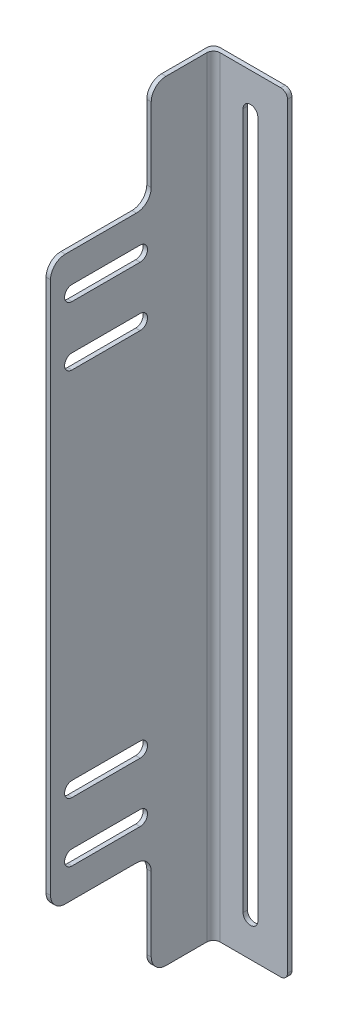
ISO-10303-21;
HEADER;
FILE_DESCRIPTION(('STEP AP214'),'2;1');
FILE_NAME('part.step','',(''),(''),'','','');
FILE_SCHEMA(('AUTOMOTIVE_DESIGN { 1 0 10303 214 1 1 1 1 }'));
ENDSEC;
DATA;
#1=APPLICATION_CONTEXT('core data for automotive mechanical design processes');
#2=APPLICATION_PROTOCOL_DEFINITION('international standard','automotive_design',2000,#1);
#3=PRODUCT_CONTEXT('',#1,'mechanical');
#4=PRODUCT('Part','Part','',(#3));
#5=PRODUCT_RELATED_PRODUCT_CATEGORY('part','',(#4));
#6=PRODUCT_DEFINITION_FORMATION('','',#4);
#7=PRODUCT_DEFINITION_CONTEXT('part definition',#1,'design');
#8=PRODUCT_DEFINITION('design','',#6,#7);
#9=PRODUCT_DEFINITION_SHAPE('','',#8);
#10=(LENGTH_UNIT() NAMED_UNIT(*) SI_UNIT(.MILLI.,.METRE.));
#11=(NAMED_UNIT(*) PLANE_ANGLE_UNIT() SI_UNIT($,.RADIAN.));
#12=(NAMED_UNIT(*) SI_UNIT($,.STERADIAN.) SOLID_ANGLE_UNIT());
#13=UNCERTAINTY_MEASURE_WITH_UNIT(LENGTH_MEASURE(1.E-05),#10,'distance_accuracy_value','');
#14=(GEOMETRIC_REPRESENTATION_CONTEXT(3) GLOBAL_UNCERTAINTY_ASSIGNED_CONTEXT((#13)) GLOBAL_UNIT_ASSIGNED_CONTEXT((#10,
#11,#12)) REPRESENTATION_CONTEXT('',''));
#15=CARTESIAN_POINT('',(0.,0.,0.));
#16=DIRECTION('',(0.,0.,1.));
#17=DIRECTION('',(1.,0.,0.));
#18=AXIS2_PLACEMENT_3D('',#15,#16,#17);
#19=CARTESIAN_POINT('',(25.,-25.,3.));
#20=DIRECTION('',(0.,0.,1.));
#21=DIRECTION('',(1.,0.,0.));
#22=AXIS2_PLACEMENT_3D('',#19,#20,#21);
#23=PLANE('',#22);
#24=DIRECTION('',(0.,1.,0.));
#25=VECTOR('',#24,1.);
#26=CARTESIAN_POINT('',(25.,495.,3.));
#27=LINE('',#26,#25);
#28=CARTESIAN_POINT('',(25.,-20.5,3.));
#29=VERTEX_POINT('',#28);
#30=CARTESIAN_POINT('',(25.,490.5,3.));
#31=VERTEX_POINT('',#30);
#32=EDGE_CURVE('E441',#29,#31,#27,.T.);
#33=ORIENTED_EDGE('',*,*,#32,.T.);
#34=CARTESIAN_POINT('',(20.5,490.5,3.));
#35=DIRECTION('',(0.,0.,1.));
#36=DIRECTION('',(1.,0.,0.));
#37=AXIS2_PLACEMENT_3D('',#34,#35,#36);
#38=CIRCLE('',#37,4.5);
#39=CARTESIAN_POINT('',(20.5,495.,3.));
#40=VERTEX_POINT('',#39);
#41=EDGE_CURVE('E668',#31,#40,#38,.T.);
#42=ORIENTED_EDGE('',*,*,#41,.T.);
#43=DIRECTION('',(-1.,0.,0.));
#44=VECTOR('',#43,1.);
#45=CARTESIAN_POINT('',(-25.,495.,3.));
#46=LINE('',#45,#44);
#47=CARTESIAN_POINT('',(-20.5,495.,3.));
#48=VERTEX_POINT('',#47);
#49=EDGE_CURVE('E434',#40,#48,#46,.T.);
#50=ORIENTED_EDGE('',*,*,#49,.T.);
#51=DIRECTION('',(0.,-1.,0.));
#52=VECTOR('',#51,1.);
#53=CARTESIAN_POINT('',(-20.5,-25.,3.));
#54=LINE('',#53,#52);
#55=CARTESIAN_POINT('',(-20.5,-25.,3.));
#56=VERTEX_POINT('',#55);
#57=EDGE_CURVE('E672',#48,#56,#54,.T.);
#58=ORIENTED_EDGE('',*,*,#57,.T.);
#59=DIRECTION('',(1.,0.,0.));
#60=VECTOR('',#59,1.);
#61=CARTESIAN_POINT('',(-25.,-25.,3.));
#62=LINE('',#61,#60);
#63=CARTESIAN_POINT('',(20.5,-25.,3.));
#64=VERTEX_POINT('',#63);
#65=EDGE_CURVE('E431',#56,#64,#62,.T.);
#66=ORIENTED_EDGE('',*,*,#65,.T.);
#67=CARTESIAN_POINT('',(20.5,-20.5,3.));
#68=DIRECTION('',(0.,0.,1.));
#69=DIRECTION('',(1.,0.,0.));
#70=AXIS2_PLACEMENT_3D('',#67,#68,#69);
#71=CIRCLE('',#70,4.5);
#72=EDGE_CURVE('E670',#64,#29,#71,.T.);
#73=ORIENTED_EDGE('',*,*,#72,.T.);
#74=EDGE_LOOP('',(#33,#42,#50,#58,#66,#73));
#75=FACE_BOUND('',#74,.T.);
#76=DIRECTION('',(0.,1.,0.));
#77=VECTOR('',#76,1.);
#78=CARTESIAN_POINT('',(5.,0.,3.));
#79=LINE('',#78,#77);
#80=CARTESIAN_POINT('',(5.,0.,3.));
#81=VERTEX_POINT('',#80);
#82=CARTESIAN_POINT('',(5.,470.,3.));
#83=VERTEX_POINT('',#82);
#84=EDGE_CURVE('E479',#81,#83,#79,.T.);
#85=ORIENTED_EDGE('',*,*,#84,.F.);
#86=CARTESIAN_POINT('',(0.,0.,3.));
#87=DIRECTION('',(0.,0.,1.));
#88=DIRECTION('',(1.,0.,0.));
#89=AXIS2_PLACEMENT_3D('',#86,#87,#88);
#90=CIRCLE('',#89,5.);
#91=CARTESIAN_POINT('',(-5.,0.,3.));
#92=VERTEX_POINT('',#91);
#93=EDGE_CURVE('E464',#92,#81,#90,.T.);
#94=ORIENTED_EDGE('',*,*,#93,.F.);
#95=DIRECTION('',(0.,-1.,0.));
#96=VECTOR('',#95,1.);
#97=CARTESIAN_POINT('',(-5.,0.,3.));
#98=LINE('',#97,#96);
#99=CARTESIAN_POINT('',(-5.,470.,3.));
#100=VERTEX_POINT('',#99);
#101=EDGE_CURVE('E460',#100,#92,#98,.T.);
#102=ORIENTED_EDGE('',*,*,#101,.F.);
#103=CARTESIAN_POINT('',(0.,470.,3.));
#104=DIRECTION('',(0.,0.,1.));
#105=DIRECTION('',(1.,0.,0.));
#106=AXIS2_PLACEMENT_3D('',#103,#104,#105);
#107=CIRCLE('',#106,5.);
#108=EDGE_CURVE('E476',#83,#100,#107,.T.);
#109=ORIENTED_EDGE('',*,*,#108,.F.);
#110=EDGE_LOOP('',(#85,#94,#102,#109));
#111=FACE_BOUND('',#110,.T.);
#112=ADVANCED_FACE('F34',(#75,#111),#23,.T.);
#113=CARTESIAN_POINT('',(25.,-25.,0.));
#114=DIRECTION('',(0.,0.,1.));
#115=DIRECTION('',(1.,0.,0.));
#116=AXIS2_PLACEMENT_3D('',#113,#114,#115);
#117=PLANE('',#116);
#118=DIRECTION('',(-1.,0.,0.));
#119=VECTOR('',#118,1.);
#120=CARTESIAN_POINT('',(-25.,495.,0.));
#121=LINE('',#120,#119);
#122=CARTESIAN_POINT('',(20.5,495.,0.));
#123=VERTEX_POINT('',#122);
#124=CARTESIAN_POINT('',(-23.5,495.,0.));
#125=VERTEX_POINT('',#124);
#126=EDGE_CURVE('E442',#123,#125,#121,.T.);
#127=ORIENTED_EDGE('',*,*,#126,.F.);
#128=CARTESIAN_POINT('',(20.5,490.5,0.));
#129=DIRECTION('',(0.,0.,1.));
#130=DIRECTION('',(1.,0.,0.));
#131=AXIS2_PLACEMENT_3D('',#128,#129,#130);
#132=CIRCLE('',#131,4.5);
#133=CARTESIAN_POINT('',(25.,490.5,0.));
#134=VERTEX_POINT('',#133);
#135=EDGE_CURVE('E680',#123,#134,#132,.F.);
#136=ORIENTED_EDGE('',*,*,#135,.T.);
#137=DIRECTION('',(0.,1.,0.));
#138=VECTOR('',#137,1.);
#139=CARTESIAN_POINT('',(25.,495.,0.));
#140=LINE('',#139,#138);
#141=CARTESIAN_POINT('',(25.,-20.5,0.));
#142=VERTEX_POINT('',#141);
#143=EDGE_CURVE('E445',#142,#134,#140,.T.);
#144=ORIENTED_EDGE('',*,*,#143,.F.);
#145=CARTESIAN_POINT('',(20.5,-20.5,0.));
#146=DIRECTION('',(0.,0.,1.));
#147=DIRECTION('',(1.,0.,0.));
#148=AXIS2_PLACEMENT_3D('',#145,#146,#147);
#149=CIRCLE('',#148,4.5);
#150=CARTESIAN_POINT('',(20.5,-25.,0.));
#151=VERTEX_POINT('',#150);
#152=EDGE_CURVE('E682',#142,#151,#149,.F.);
#153=ORIENTED_EDGE('',*,*,#152,.T.);
#154=DIRECTION('',(1.,0.,0.));
#155=VECTOR('',#154,1.);
#156=CARTESIAN_POINT('',(-25.,-25.,0.));
#157=LINE('',#156,#155);
#158=CARTESIAN_POINT('',(-23.5,-25.,0.));
#159=VERTEX_POINT('',#158);
#160=EDGE_CURVE('E438',#159,#151,#157,.T.);
#161=ORIENTED_EDGE('',*,*,#160,.F.);
#162=DIRECTION('',(0.,-1.,0.));
#163=VECTOR('',#162,1.);
#164=CARTESIAN_POINT('',(-23.5,495.,0.));
#165=LINE('',#164,#163);
#166=EDGE_CURVE('E684',#159,#125,#165,.F.);
#167=ORIENTED_EDGE('',*,*,#166,.T.);
#168=EDGE_LOOP('',(#127,#136,#144,#153,#161,#167));
#169=FACE_BOUND('',#168,.T.);
#170=CARTESIAN_POINT('',(0.,0.,0.));
#171=DIRECTION('',(0.,0.,1.));
#172=DIRECTION('',(1.,0.,0.));
#173=AXIS2_PLACEMENT_3D('',#170,#171,#172);
#174=CIRCLE('',#173,5.);
#175=CARTESIAN_POINT('',(-5.,0.,0.));
#176=VERTEX_POINT('',#175);
#177=CARTESIAN_POINT('',(5.,0.,0.));
#178=VERTEX_POINT('',#177);
#179=EDGE_CURVE('E471',#176,#178,#174,.T.);
#180=ORIENTED_EDGE('',*,*,#179,.T.);
#181=DIRECTION('',(0.,1.,0.));
#182=VECTOR('',#181,1.);
#183=CARTESIAN_POINT('',(5.,0.,0.));
#184=LINE('',#183,#182);
#185=CARTESIAN_POINT('',(5.,470.,0.));
#186=VERTEX_POINT('',#185);
#187=EDGE_CURVE('E468',#178,#186,#184,.T.);
#188=ORIENTED_EDGE('',*,*,#187,.T.);
#189=CARTESIAN_POINT('',(0.,470.,0.));
#190=DIRECTION('',(0.,0.,1.));
#191=DIRECTION('',(1.,0.,0.));
#192=AXIS2_PLACEMENT_3D('',#189,#190,#191);
#193=CIRCLE('',#192,5.);
#194=CARTESIAN_POINT('',(-5.,470.,0.));
#195=VERTEX_POINT('',#194);
#196=EDGE_CURVE('E465',#186,#195,#193,.T.);
#197=ORIENTED_EDGE('',*,*,#196,.T.);
#198=DIRECTION('',(0.,-1.,0.));
#199=VECTOR('',#198,1.);
#200=CARTESIAN_POINT('',(-5.,0.,0.));
#201=LINE('',#200,#199);
#202=EDGE_CURVE('E461',#195,#176,#201,.T.);
#203=ORIENTED_EDGE('',*,*,#202,.T.);
#204=EDGE_LOOP('',(#180,#188,#197,#203));
#205=FACE_BOUND('',#204,.T.);
#206=ADVANCED_FACE('F539',(#169,#205),#117,.F.);
#207=CARTESIAN_POINT('',(25.,495.,3.));
#208=DIRECTION('',(-1.,0.,0.));
#209=DIRECTION('',(0.,0.,1.));
#210=AXIS2_PLACEMENT_3D('',#207,#208,#209);
#211=PLANE('',#210);
#212=ORIENTED_EDGE('',*,*,#143,.T.);
#213=DIRECTION('',(0.,0.,-1.));
#214=VECTOR('',#213,1.);
#215=CARTESIAN_POINT('',(25.,490.5,3.));
#216=LINE('',#215,#214);
#217=EDGE_CURVE('E675',#134,#31,#216,.F.);
#218=ORIENTED_EDGE('',*,*,#217,.T.);
#219=ORIENTED_EDGE('',*,*,#32,.F.);
#220=DIRECTION('',(0.,0.,-1.));
#221=VECTOR('',#220,1.);
#222=CARTESIAN_POINT('',(25.,-20.5,3.));
#223=LINE('',#222,#221);
#224=EDGE_CURVE('E677',#29,#142,#223,.T.);
#225=ORIENTED_EDGE('',*,*,#224,.T.);
#226=EDGE_LOOP('',(#212,#218,#219,#225));
#227=FACE_BOUND('',#226,.T.);
#228=ADVANCED_FACE('F545',(#227),#211,.F.);
#229=CARTESIAN_POINT('',(-25.,495.,3.));
#230=DIRECTION('',(0.,-1.,0.));
#231=DIRECTION('',(0.,0.,-1.));
#232=AXIS2_PLACEMENT_3D('',#229,#230,#231);
#233=PLANE('',#232);
#234=DIRECTION('',(0.,0.,1.));
#235=VECTOR('',#234,1.);
#236=CARTESIAN_POINT('',(-28.,495.,56.4999999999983));
#237=LINE('',#236,#235);
#238=CARTESIAN_POINT('',(-28.,495.,4.5));
#239=VERTEX_POINT('',#238);
#240=CARTESIAN_POINT('',(-28.,495.,35.));
#241=VERTEX_POINT('',#240);
#242=EDGE_CURVE('E359',#239,#241,#237,.T.);
#243=ORIENTED_EDGE('',*,*,#242,.T.);
#244=DIRECTION('',(-1.,0.,0.));
#245=VECTOR('',#244,1.);
#246=CARTESIAN_POINT('',(-25.,495.,35.));
#247=LINE('',#246,#245);
#248=CARTESIAN_POINT('',(-25.,495.,35.));
#249=VERTEX_POINT('',#248);
#250=EDGE_CURVE('E624',#241,#249,#247,.F.);
#251=ORIENTED_EDGE('',*,*,#250,.T.);
#252=DIRECTION('',(0.,0.,1.));
#253=VECTOR('',#252,1.);
#254=CARTESIAN_POINT('',(-25.,495.,56.4999999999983));
#255=LINE('',#254,#253);
#256=CARTESIAN_POINT('',(-25.,495.,7.5));
#257=VERTEX_POINT('',#256);
#258=EDGE_CURVE('E415',#257,#249,#255,.T.);
#259=ORIENTED_EDGE('',*,*,#258,.F.);
#260=CARTESIAN_POINT('',(-20.5,495.,7.5));
#261=DIRECTION('',(0.,-1.,0.));
#262=DIRECTION('',(0.,0.,-1.));
#263=AXIS2_PLACEMENT_3D('',#260,#261,#262);
#264=CIRCLE('',#263,4.5);
#265=EDGE_CURVE('E664',#257,#48,#264,.T.);
#266=ORIENTED_EDGE('',*,*,#265,.T.);
#267=ORIENTED_EDGE('',*,*,#49,.F.);
#268=DIRECTION('',(0.,0.,-1.));
#269=VECTOR('',#268,1.);
#270=CARTESIAN_POINT('',(20.5,495.,3.));
#271=LINE('',#270,#269);
#272=EDGE_CURVE('E686',#40,#123,#271,.T.);
#273=ORIENTED_EDGE('',*,*,#272,.T.);
#274=ORIENTED_EDGE('',*,*,#126,.T.);
#275=CARTESIAN_POINT('',(-23.5,495.,4.5));
#276=DIRECTION('',(0.,-1.,0.));
#277=DIRECTION('',(0.,0.,-1.));
#278=AXIS2_PLACEMENT_3D('',#275,#276,#277);
#279=CIRCLE('',#278,4.5);
#280=EDGE_CURVE('E689',#125,#239,#279,.F.);
#281=ORIENTED_EDGE('',*,*,#280,.T.);
#282=EDGE_LOOP('',(#243,#251,#259,#266,#267,#273,#274,#281));
#283=FACE_BOUND('',#282,.T.);
#284=ADVANCED_FACE('F556',(#283),#233,.F.);
#285=CARTESIAN_POINT('',(-25.,-25.,3.));
#286=DIRECTION('',(0.,1.,0.));
#287=DIRECTION('',(0.,0.,1.));
#288=AXIS2_PLACEMENT_3D('',#285,#286,#287);
#289=PLANE('',#288);
#290=DIRECTION('',(0.,0.,1.));
#291=VECTOR('',#290,1.);
#292=CARTESIAN_POINT('',(-25.,-25.,56.5));
#293=LINE('',#292,#291);
#294=CARTESIAN_POINT('',(-25.,-25.,7.5));
#295=VERTEX_POINT('',#294);
#296=CARTESIAN_POINT('',(-25.,-25.,35.));
#297=VERTEX_POINT('',#296);
#298=EDGE_CURVE('E314',#295,#297,#293,.T.);
#299=ORIENTED_EDGE('',*,*,#298,.T.);
#300=DIRECTION('',(-1.,0.,0.));
#301=VECTOR('',#300,1.);
#302=CARTESIAN_POINT('',(-25.,-25.,35.));
#303=LINE('',#302,#301);
#304=CARTESIAN_POINT('',(-28.,-25.,35.));
#305=VERTEX_POINT('',#304);
#306=EDGE_CURVE('E661',#297,#305,#303,.T.);
#307=ORIENTED_EDGE('',*,*,#306,.T.);
#308=DIRECTION('',(0.,0.,1.));
#309=VECTOR('',#308,1.);
#310=CARTESIAN_POINT('',(-28.,-25.,56.5));
#311=LINE('',#310,#309);
#312=CARTESIAN_POINT('',(-28.,-25.,4.5));
#313=VERTEX_POINT('',#312);
#314=EDGE_CURVE('E362',#313,#305,#311,.T.);
#315=ORIENTED_EDGE('',*,*,#314,.F.);
#316=CARTESIAN_POINT('',(-23.5,-25.,4.5));
#317=DIRECTION('',(0.,1.,0.));
#318=DIRECTION('',(0.,0.,1.));
#319=AXIS2_PLACEMENT_3D('',#316,#317,#318);
#320=CIRCLE('',#319,4.5);
#321=EDGE_CURVE('E430',#313,#159,#320,.F.);
#322=ORIENTED_EDGE('',*,*,#321,.T.);
#323=ORIENTED_EDGE('',*,*,#160,.T.);
#324=DIRECTION('',(0.,0.,-1.));
#325=VECTOR('',#324,1.);
#326=CARTESIAN_POINT('',(20.5,-25.,3.));
#327=LINE('',#326,#325);
#328=EDGE_CURVE('E695',#151,#64,#327,.F.);
#329=ORIENTED_EDGE('',*,*,#328,.T.);
#330=ORIENTED_EDGE('',*,*,#65,.F.);
#331=CARTESIAN_POINT('',(-20.5,-25.,7.5));
#332=DIRECTION('',(0.,1.,0.));
#333=DIRECTION('',(0.,0.,1.));
#334=AXIS2_PLACEMENT_3D('',#331,#332,#333);
#335=CIRCLE('',#334,4.5);
#336=EDGE_CURVE('E666',#56,#295,#335,.T.);
#337=ORIENTED_EDGE('',*,*,#336,.T.);
#338=EDGE_LOOP('',(#299,#307,#315,#322,#323,#329,#330,#337));
#339=FACE_BOUND('',#338,.T.);
#340=ADVANCED_FACE('F553',(#339),#289,.F.);
#341=CARTESIAN_POINT('',(0.,0.,3.));
#342=DIRECTION('',(0.,0.,-1.));
#343=DIRECTION('',(-1.,0.,0.));
#344=AXIS2_PLACEMENT_3D('',#341,#342,#343);
#345=CYLINDRICAL_SURFACE('',#344,5.);
#346=ORIENTED_EDGE('',*,*,#179,.F.);
#347=DIRECTION('',(0.,0.,-1.));
#348=VECTOR('',#347,1.);
#349=CARTESIAN_POINT('',(-5.,0.,3.));
#350=LINE('',#349,#348);
#351=EDGE_CURVE('E457',#92,#176,#350,.T.);
#352=ORIENTED_EDGE('',*,*,#351,.F.);
#353=ORIENTED_EDGE('',*,*,#93,.T.);
#354=DIRECTION('',(0.,0.,-1.));
#355=VECTOR('',#354,1.);
#356=CARTESIAN_POINT('',(5.,0.,3.));
#357=LINE('',#356,#355);
#358=EDGE_CURVE('E448',#81,#178,#357,.T.);
#359=ORIENTED_EDGE('',*,*,#358,.T.);
#360=EDGE_LOOP('',(#346,#352,#353,#359));
#361=FACE_BOUND('',#360,.T.);
#362=ADVANCED_FACE('F550',(#361),#345,.F.);
#363=CARTESIAN_POINT('',(5.,0.,3.));
#364=DIRECTION('',(-1.,0.,0.));
#365=DIRECTION('',(0.,0.,1.));
#366=AXIS2_PLACEMENT_3D('',#363,#364,#365);
#367=PLANE('',#366);
#368=ORIENTED_EDGE('',*,*,#187,.F.);
#369=ORIENTED_EDGE('',*,*,#358,.F.);
#370=ORIENTED_EDGE('',*,*,#84,.T.);
#371=DIRECTION('',(0.,0.,-1.));
#372=VECTOR('',#371,1.);
#373=CARTESIAN_POINT('',(5.,470.,3.));
#374=LINE('',#373,#372);
#375=EDGE_CURVE('E453',#83,#186,#374,.T.);
#376=ORIENTED_EDGE('',*,*,#375,.T.);
#377=EDGE_LOOP('',(#368,#369,#370,#376));
#378=FACE_BOUND('',#377,.T.);
#379=ADVANCED_FACE('F812',(#378),#367,.T.);
#380=CARTESIAN_POINT('',(0.,470.,3.));
#381=DIRECTION('',(0.,0.,-1.));
#382=DIRECTION('',(-1.,0.,0.));
#383=AXIS2_PLACEMENT_3D('',#380,#381,#382);
#384=CYLINDRICAL_SURFACE('',#383,5.);
#385=ORIENTED_EDGE('',*,*,#196,.F.);
#386=ORIENTED_EDGE('',*,*,#375,.F.);
#387=ORIENTED_EDGE('',*,*,#108,.T.);
#388=DIRECTION('',(0.,0.,-1.));
#389=VECTOR('',#388,1.);
#390=CARTESIAN_POINT('',(-5.,470.,3.));
#391=LINE('',#390,#389);
#392=EDGE_CURVE('E455',#100,#195,#391,.T.);
#393=ORIENTED_EDGE('',*,*,#392,.T.);
#394=EDGE_LOOP('',(#385,#386,#387,#393));
#395=FACE_BOUND('',#394,.T.);
#396=ADVANCED_FACE('F809',(#395),#384,.F.);
#397=CARTESIAN_POINT('',(-5.,0.,3.));
#398=DIRECTION('',(1.,0.,0.));
#399=DIRECTION('',(0.,0.,-1.));
#400=AXIS2_PLACEMENT_3D('',#397,#398,#399);
#401=PLANE('',#400);
#402=ORIENTED_EDGE('',*,*,#202,.F.);
#403=ORIENTED_EDGE('',*,*,#392,.F.);
#404=ORIENTED_EDGE('',*,*,#101,.T.);
#405=ORIENTED_EDGE('',*,*,#351,.T.);
#406=EDGE_LOOP('',(#402,#403,#404,#405));
#407=FACE_BOUND('',#406,.T.);
#408=ADVANCED_FACE('F786',(#407),#401,.T.);
#409=CARTESIAN_POINT('',(-28.,-179.046295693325,113.));
#410=DIRECTION('',(0.,0.,1.));
#411=DIRECTION('',(0.,-1.,0.));
#412=AXIS2_PLACEMENT_3D('',#409,#410,#411);
#413=PLANE('',#412);
#414=DIRECTION('',(0.,-1.,0.));
#415=VECTOR('',#414,1.);
#416=CARTESIAN_POINT('',(-28.,-179.046295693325,113.));
#417=LINE('',#416,#415);
#418=CARTESIAN_POINT('',(-28.,415.,113.));
#419=VERTEX_POINT('',#418);
#420=CARTESIAN_POINT('',(-28.,55.,113.));
#421=VERTEX_POINT('',#420);
#422=EDGE_CURVE('E356',#419,#421,#417,.T.);
#423=ORIENTED_EDGE('',*,*,#422,.T.);
#424=DIRECTION('',(-1.,0.,0.));
#425=VECTOR('',#424,1.);
#426=CARTESIAN_POINT('',(-25.,55.,113.));
#427=LINE('',#426,#425);
#428=CARTESIAN_POINT('',(-25.,55.,113.));
#429=VERTEX_POINT('',#428);
#430=EDGE_CURVE('E632',#421,#429,#427,.F.);
#431=ORIENTED_EDGE('',*,*,#430,.T.);
#432=DIRECTION('',(0.,-1.,0.));
#433=VECTOR('',#432,1.);
#434=CARTESIAN_POINT('',(-25.,-179.046295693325,113.));
#435=LINE('',#434,#433);
#436=CARTESIAN_POINT('',(-25.,415.,113.));
#437=VERTEX_POINT('',#436);
#438=EDGE_CURVE('E412',#437,#429,#435,.T.);
#439=ORIENTED_EDGE('',*,*,#438,.F.);
#440=DIRECTION('',(-1.,0.,0.));
#441=VECTOR('',#440,1.);
#442=CARTESIAN_POINT('',(-28.,415.,113.));
#443=LINE('',#442,#441);
#444=EDGE_CURVE('E634',#437,#419,#443,.T.);
#445=ORIENTED_EDGE('',*,*,#444,.T.);
#446=EDGE_LOOP('',(#423,#431,#439,#445));
#447=FACE_BOUND('',#446,.T.);
#448=ADVANCED_FACE('F784',(#447),#413,.T.);
#449=CARTESIAN_POINT('',(-28.,360.,98.5));
#450=DIRECTION('',(1.,0.,0.));
#451=DIRECTION('',(0.,0.,-1.));
#452=AXIS2_PLACEMENT_3D('',#449,#450,#451);
#453=CYLINDRICAL_SURFACE('',#452,5.);
#454=CARTESIAN_POINT('',(-25.,360.,98.5));
#455=DIRECTION('',(-1.,0.,0.));
#456=DIRECTION('',(0.,0.,1.));
#457=AXIS2_PLACEMENT_3D('',#454,#455,#456);
#458=CIRCLE('',#457,5.);
#459=CARTESIAN_POINT('',(-25.,355.,98.5));
#460=VERTEX_POINT('',#459);
#461=CARTESIAN_POINT('',(-25.,365.,98.5));
#462=VERTEX_POINT('',#461);
#463=EDGE_CURVE('E400',#460,#462,#458,.T.);
#464=ORIENTED_EDGE('',*,*,#463,.F.);
#465=DIRECTION('',(1.,0.,0.));
#466=VECTOR('',#465,1.);
#467=CARTESIAN_POINT('',(-28.,355.,98.5));
#468=LINE('',#467,#466);
#469=CARTESIAN_POINT('',(-28.,355.,98.5));
#470=VERTEX_POINT('',#469);
#471=EDGE_CURVE('E474',#470,#460,#468,.T.);
#472=ORIENTED_EDGE('',*,*,#471,.F.);
#473=CARTESIAN_POINT('',(-28.,360.,98.5));
#474=DIRECTION('',(-1.,0.,0.));
#475=DIRECTION('',(0.,0.,1.));
#476=AXIS2_PLACEMENT_3D('',#473,#474,#475);
#477=CIRCLE('',#476,5.);
#478=CARTESIAN_POINT('',(-28.,365.,98.5));
#479=VERTEX_POINT('',#478);
#480=EDGE_CURVE('E345',#470,#479,#477,.T.);
#481=ORIENTED_EDGE('',*,*,#480,.T.);
#482=DIRECTION('',(1.,0.,0.));
#483=VECTOR('',#482,1.);
#484=CARTESIAN_POINT('',(-28.,365.,98.5));
#485=LINE('',#484,#483);
#486=EDGE_CURVE('E496',#479,#462,#485,.T.);
#487=ORIENTED_EDGE('',*,*,#486,.T.);
#488=EDGE_LOOP('',(#464,#472,#481,#487));
#489=FACE_BOUND('',#488,.T.);
#490=ADVANCED_FACE('F509',(#489),#453,.F.);
#491=CARTESIAN_POINT('',(-28.,355.,56.5));
#492=DIRECTION('',(0.,1.,0.));
#493=DIRECTION('',(0.,0.,1.));
#494=AXIS2_PLACEMENT_3D('',#491,#492,#493);
#495=PLANE('',#494);
#496=DIRECTION('',(0.,0.,1.));
#497=VECTOR('',#496,1.);
#498=CARTESIAN_POINT('',(-25.,355.,56.5));
#499=LINE('',#498,#497);
#500=CARTESIAN_POINT('',(-25.,355.,52.5));
#501=VERTEX_POINT('',#500);
#502=EDGE_CURVE('E403',#501,#460,#499,.T.);
#503=ORIENTED_EDGE('',*,*,#502,.F.);
#504=DIRECTION('',(1.,0.,0.));
#505=VECTOR('',#504,1.);
#506=CARTESIAN_POINT('',(-28.,355.,52.5));
#507=LINE('',#506,#505);
#508=CARTESIAN_POINT('',(-28.,355.,52.5));
#509=VERTEX_POINT('',#508);
#510=EDGE_CURVE('E503',#509,#501,#507,.T.);
#511=ORIENTED_EDGE('',*,*,#510,.F.);
#512=DIRECTION('',(0.,0.,1.));
#513=VECTOR('',#512,1.);
#514=CARTESIAN_POINT('',(-28.,355.,56.5));
#515=LINE('',#514,#513);
#516=EDGE_CURVE('E348',#509,#470,#515,.T.);
#517=ORIENTED_EDGE('',*,*,#516,.T.);
#518=ORIENTED_EDGE('',*,*,#471,.T.);
#519=EDGE_LOOP('',(#503,#511,#517,#518));
#520=FACE_BOUND('',#519,.T.);
#521=ADVANCED_FACE('F520',(#520),#495,.T.);
#522=CARTESIAN_POINT('',(-28.,360.,52.5));
#523=DIRECTION('',(1.,0.,0.));
#524=DIRECTION('',(0.,0.,-1.));
#525=AXIS2_PLACEMENT_3D('',#522,#523,#524);
#526=CYLINDRICAL_SURFACE('',#525,5.);
#527=CARTESIAN_POINT('',(-25.,360.,52.5));
#528=DIRECTION('',(-1.,0.,0.));
#529=DIRECTION('',(0.,0.,1.));
#530=AXIS2_PLACEMENT_3D('',#527,#528,#529);
#531=CIRCLE('',#530,5.);
#532=CARTESIAN_POINT('',(-25.,365.,52.5));
#533=VERTEX_POINT('',#532);
#534=EDGE_CURVE('E406',#533,#501,#531,.T.);
#535=ORIENTED_EDGE('',*,*,#534,.F.);
#536=DIRECTION('',(1.,0.,0.));
#537=VECTOR('',#536,1.);
#538=CARTESIAN_POINT('',(-28.,365.,52.5));
#539=LINE('',#538,#537);
#540=CARTESIAN_POINT('',(-28.,365.,52.5));
#541=VERTEX_POINT('',#540);
#542=EDGE_CURVE('E505',#541,#533,#539,.T.);
#543=ORIENTED_EDGE('',*,*,#542,.F.);
#544=CARTESIAN_POINT('',(-28.,360.,52.5));
#545=DIRECTION('',(-1.,0.,0.));
#546=DIRECTION('',(0.,0.,1.));
#547=AXIS2_PLACEMENT_3D('',#544,#545,#546);
#548=CIRCLE('',#547,5.);
#549=EDGE_CURVE('E351',#541,#509,#548,.T.);
#550=ORIENTED_EDGE('',*,*,#549,.T.);
#551=ORIENTED_EDGE('',*,*,#510,.T.);
#552=EDGE_LOOP('',(#535,#543,#550,#551));
#553=FACE_BOUND('',#552,.T.);
#554=ADVANCED_FACE('F525',(#553),#526,.F.);
#555=CARTESIAN_POINT('',(-28.,110.,98.5));
#556=DIRECTION('',(1.,0.,0.));
#557=DIRECTION('',(0.,0.,-1.));
#558=AXIS2_PLACEMENT_3D('',#555,#556,#557);
#559=CYLINDRICAL_SURFACE('',#558,4.99999999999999);
#560=CARTESIAN_POINT('',(-25.,110.,98.5));
#561=DIRECTION('',(-1.,0.,0.));
#562=DIRECTION('',(0.,0.,1.));
#563=AXIS2_PLACEMENT_3D('',#560,#561,#562);
#564=CIRCLE('',#563,4.99999999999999);
#565=CARTESIAN_POINT('',(-25.,105.,98.5));
#566=VERTEX_POINT('',#565);
#567=CARTESIAN_POINT('',(-25.,115.,98.5));
#568=VERTEX_POINT('',#567);
#569=EDGE_CURVE('E388',#566,#568,#564,.T.);
#570=ORIENTED_EDGE('',*,*,#569,.F.);
#571=DIRECTION('',(1.,0.,0.));
#572=VECTOR('',#571,1.);
#573=CARTESIAN_POINT('',(-28.,105.,98.5));
#574=LINE('',#573,#572);
#575=CARTESIAN_POINT('',(-28.,105.,98.5));
#576=VERTEX_POINT('',#575);
#577=EDGE_CURVE('E494',#576,#566,#574,.T.);
#578=ORIENTED_EDGE('',*,*,#577,.F.);
#579=CARTESIAN_POINT('',(-28.,110.,98.5));
#580=DIRECTION('',(-1.,0.,0.));
#581=DIRECTION('',(0.,0.,1.));
#582=AXIS2_PLACEMENT_3D('',#579,#580,#581);
#583=CIRCLE('',#582,4.99999999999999);
#584=CARTESIAN_POINT('',(-28.,115.,98.5));
#585=VERTEX_POINT('',#584);
#586=EDGE_CURVE('E334',#576,#585,#583,.T.);
#587=ORIENTED_EDGE('',*,*,#586,.T.);
#588=DIRECTION('',(1.,0.,0.));
#589=VECTOR('',#588,1.);
#590=CARTESIAN_POINT('',(-28.,115.,98.5));
#591=LINE('',#590,#589);
#592=EDGE_CURVE('E488',#585,#568,#591,.T.);
#593=ORIENTED_EDGE('',*,*,#592,.T.);
#594=EDGE_LOOP('',(#570,#578,#587,#593));
#595=FACE_BOUND('',#594,.T.);
#596=ADVANCED_FACE('F527',(#595),#559,.F.);
#597=CARTESIAN_POINT('',(-28.,105.,56.5));
#598=DIRECTION('',(0.,1.,0.));
#599=DIRECTION('',(0.,0.,1.));
#600=AXIS2_PLACEMENT_3D('',#597,#598,#599);
#601=PLANE('',#600);
#602=DIRECTION('',(0.,0.,1.));
#603=VECTOR('',#602,1.);
#604=CARTESIAN_POINT('',(-25.,105.,56.5));
#605=LINE('',#604,#603);
#606=CARTESIAN_POINT('',(-25.,105.,52.5));
#607=VERTEX_POINT('',#606);
#608=EDGE_CURVE('E391',#607,#566,#605,.T.);
#609=ORIENTED_EDGE('',*,*,#608,.F.);
#610=DIRECTION('',(1.,0.,0.));
#611=VECTOR('',#610,1.);
#612=CARTESIAN_POINT('',(-28.,105.,52.5));
#613=LINE('',#612,#611);
#614=CARTESIAN_POINT('',(-28.,105.,52.5));
#615=VERTEX_POINT('',#614);
#616=EDGE_CURVE('E497',#615,#607,#613,.T.);
#617=ORIENTED_EDGE('',*,*,#616,.F.);
#618=DIRECTION('',(0.,0.,1.));
#619=VECTOR('',#618,1.);
#620=CARTESIAN_POINT('',(-28.,105.,56.5));
#621=LINE('',#620,#619);
#622=EDGE_CURVE('E337',#615,#576,#621,.T.);
#623=ORIENTED_EDGE('',*,*,#622,.T.);
#624=ORIENTED_EDGE('',*,*,#577,.T.);
#625=EDGE_LOOP('',(#609,#617,#623,#624));
#626=FACE_BOUND('',#625,.T.);
#627=ADVANCED_FACE('F533',(#626),#601,.T.);
#628=CARTESIAN_POINT('',(-28.,110.,52.5));
#629=DIRECTION('',(1.,0.,0.));
#630=DIRECTION('',(0.,0.,-1.));
#631=AXIS2_PLACEMENT_3D('',#628,#629,#630);
#632=CYLINDRICAL_SURFACE('',#631,4.99999999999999);
#633=CARTESIAN_POINT('',(-25.,110.,52.5));
#634=DIRECTION('',(-1.,0.,0.));
#635=DIRECTION('',(0.,0.,1.));
#636=AXIS2_PLACEMENT_3D('',#633,#634,#635);
#637=CIRCLE('',#636,4.99999999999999);
#638=CARTESIAN_POINT('',(-25.,115.,52.5));
#639=VERTEX_POINT('',#638);
#640=EDGE_CURVE('E394',#639,#607,#637,.T.);
#641=ORIENTED_EDGE('',*,*,#640,.F.);
#642=DIRECTION('',(1.,0.,0.));
#643=VECTOR('',#642,1.);
#644=CARTESIAN_POINT('',(-28.,115.,52.5));
#645=LINE('',#644,#643);
#646=CARTESIAN_POINT('',(-28.,115.,52.5));
#647=VERTEX_POINT('',#646);
#648=EDGE_CURVE('E499',#647,#639,#645,.T.);
#649=ORIENTED_EDGE('',*,*,#648,.F.);
#650=CARTESIAN_POINT('',(-28.,110.,52.5));
#651=DIRECTION('',(-1.,0.,0.));
#652=DIRECTION('',(0.,0.,1.));
#653=AXIS2_PLACEMENT_3D('',#650,#651,#652);
#654=CIRCLE('',#653,4.99999999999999);
#655=EDGE_CURVE('E340',#647,#615,#654,.T.);
#656=ORIENTED_EDGE('',*,*,#655,.T.);
#657=ORIENTED_EDGE('',*,*,#616,.T.);
#658=EDGE_LOOP('',(#641,#649,#656,#657));
#659=FACE_BOUND('',#658,.T.);
#660=ADVANCED_FACE('F768',(#659),#632,.F.);
#661=CARTESIAN_POINT('',(-28.,70.,52.5));
#662=DIRECTION('',(1.,0.,0.));
#663=DIRECTION('',(0.,0.,-1.));
#664=AXIS2_PLACEMENT_3D('',#661,#662,#663);
#665=CYLINDRICAL_SURFACE('',#664,4.99999999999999);
#666=CARTESIAN_POINT('',(-25.,70.,52.5));
#667=DIRECTION('',(-1.,0.,0.));
#668=DIRECTION('',(0.,0.,1.));
#669=AXIS2_PLACEMENT_3D('',#666,#667,#668);
#670=CIRCLE('',#669,4.99999999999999);
#671=CARTESIAN_POINT('',(-25.,75.,52.5));
#672=VERTEX_POINT('',#671);
#673=CARTESIAN_POINT('',(-25.,65.,52.5));
#674=VERTEX_POINT('',#673);
#675=EDGE_CURVE('E376',#672,#674,#670,.T.);
#676=ORIENTED_EDGE('',*,*,#675,.F.);
#677=DIRECTION('',(1.,0.,0.));
#678=VECTOR('',#677,1.);
#679=CARTESIAN_POINT('',(-28.,75.,52.5));
#680=LINE('',#679,#678);
#681=CARTESIAN_POINT('',(-28.,75.,52.5));
#682=VERTEX_POINT('',#681);
#683=EDGE_CURVE('E486',#682,#672,#680,.T.);
#684=ORIENTED_EDGE('',*,*,#683,.F.);
#685=CARTESIAN_POINT('',(-28.,70.,52.5));
#686=DIRECTION('',(-1.,0.,0.));
#687=DIRECTION('',(0.,0.,1.));
#688=AXIS2_PLACEMENT_3D('',#685,#686,#687);
#689=CIRCLE('',#688,4.99999999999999);
#690=CARTESIAN_POINT('',(-28.,65.,52.5));
#691=VERTEX_POINT('',#690);
#692=EDGE_CURVE('E323',#682,#691,#689,.T.);
#693=ORIENTED_EDGE('',*,*,#692,.T.);
#694=DIRECTION('',(1.,0.,0.));
#695=VECTOR('',#694,1.);
#696=CARTESIAN_POINT('',(-28.,65.,52.5));
#697=LINE('',#696,#695);
#698=EDGE_CURVE('E301',#691,#674,#697,.T.);
#699=ORIENTED_EDGE('',*,*,#698,.T.);
#700=EDGE_LOOP('',(#676,#684,#693,#699));
#701=FACE_BOUND('',#700,.T.);
#702=ADVANCED_FACE('F918',(#701),#665,.F.);
#703=CARTESIAN_POINT('',(-28.,75.,56.5));
#704=DIRECTION('',(0.,-1.,0.));
#705=DIRECTION('',(0.,0.,-1.));
#706=AXIS2_PLACEMENT_3D('',#703,#704,#705);
#707=PLANE('',#706);
#708=DIRECTION('',(0.,0.,-1.));
#709=VECTOR('',#708,1.);
#710=CARTESIAN_POINT('',(-25.,75.,56.5));
#711=LINE('',#710,#709);
#712=CARTESIAN_POINT('',(-25.,75.,98.5));
#713=VERTEX_POINT('',#712);
#714=EDGE_CURVE('E379',#713,#672,#711,.T.);
#715=ORIENTED_EDGE('',*,*,#714,.F.);
#716=DIRECTION('',(1.,0.,0.));
#717=VECTOR('',#716,1.);
#718=CARTESIAN_POINT('',(-28.,75.,98.5));
#719=LINE('',#718,#717);
#720=CARTESIAN_POINT('',(-28.,75.,98.5));
#721=VERTEX_POINT('',#720);
#722=EDGE_CURVE('E489',#721,#713,#719,.T.);
#723=ORIENTED_EDGE('',*,*,#722,.F.);
#724=DIRECTION('',(0.,0.,-1.));
#725=VECTOR('',#724,1.);
#726=CARTESIAN_POINT('',(-28.,75.,56.5));
#727=LINE('',#726,#725);
#728=EDGE_CURVE('E326',#721,#682,#727,.T.);
#729=ORIENTED_EDGE('',*,*,#728,.T.);
#730=ORIENTED_EDGE('',*,*,#683,.T.);
#731=EDGE_LOOP('',(#715,#723,#729,#730));
#732=FACE_BOUND('',#731,.T.);
#733=ADVANCED_FACE('F908',(#732),#707,.T.);
#734=CARTESIAN_POINT('',(-28.,70.,98.5));
#735=DIRECTION('',(1.,0.,0.));
#736=DIRECTION('',(0.,0.,-1.));
#737=AXIS2_PLACEMENT_3D('',#734,#735,#736);
#738=CYLINDRICAL_SURFACE('',#737,4.99999999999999);
#739=CARTESIAN_POINT('',(-25.,70.,98.5));
#740=DIRECTION('',(-1.,0.,0.));
#741=DIRECTION('',(0.,0.,1.));
#742=AXIS2_PLACEMENT_3D('',#739,#740,#741);
#743=CIRCLE('',#742,4.99999999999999);
#744=CARTESIAN_POINT('',(-25.,65.,98.5));
#745=VERTEX_POINT('',#744);
#746=EDGE_CURVE('E382',#745,#713,#743,.T.);
#747=ORIENTED_EDGE('',*,*,#746,.F.);
#748=DIRECTION('',(1.,0.,0.));
#749=VECTOR('',#748,1.);
#750=CARTESIAN_POINT('',(-28.,65.,98.5));
#751=LINE('',#750,#749);
#752=CARTESIAN_POINT('',(-28.,65.,98.5));
#753=VERTEX_POINT('',#752);
#754=EDGE_CURVE('E491',#753,#745,#751,.T.);
#755=ORIENTED_EDGE('',*,*,#754,.F.);
#756=CARTESIAN_POINT('',(-28.,70.,98.5));
#757=DIRECTION('',(-1.,0.,0.));
#758=DIRECTION('',(0.,0.,1.));
#759=AXIS2_PLACEMENT_3D('',#756,#757,#758);
#760=CIRCLE('',#759,4.99999999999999);
#761=EDGE_CURVE('E329',#753,#721,#760,.T.);
#762=ORIENTED_EDGE('',*,*,#761,.T.);
#763=ORIENTED_EDGE('',*,*,#722,.T.);
#764=EDGE_LOOP('',(#747,#755,#762,#763));
#765=FACE_BOUND('',#764,.T.);
#766=ADVANCED_FACE('F806',(#765),#738,.F.);
#767=CARTESIAN_POINT('',(-28.,400.,52.5));
#768=DIRECTION('',(1.,0.,0.));
#769=DIRECTION('',(0.,0.,-1.));
#770=AXIS2_PLACEMENT_3D('',#767,#768,#769);
#771=CYLINDRICAL_SURFACE('',#770,5.);
#772=CARTESIAN_POINT('',(-25.,400.,52.5));
#773=DIRECTION('',(-1.,0.,0.));
#774=DIRECTION('',(0.,0.,1.));
#775=AXIS2_PLACEMENT_3D('',#772,#773,#774);
#776=CIRCLE('',#775,5.);
#777=CARTESIAN_POINT('',(-25.,405.,52.5));
#778=VERTEX_POINT('',#777);
#779=CARTESIAN_POINT('',(-25.,395.,52.5));
#780=VERTEX_POINT('',#779);
#781=EDGE_CURVE('E296',#778,#780,#776,.T.);
#782=ORIENTED_EDGE('',*,*,#781,.F.);
#783=DIRECTION('',(1.,0.,0.));
#784=VECTOR('',#783,1.);
#785=CARTESIAN_POINT('',(-28.,405.,52.5));
#786=LINE('',#785,#784);
#787=CARTESIAN_POINT('',(-28.,405.,52.5));
#788=VERTEX_POINT('',#787);
#789=EDGE_CURVE('E291',#788,#778,#786,.T.);
#790=ORIENTED_EDGE('',*,*,#789,.F.);
#791=CARTESIAN_POINT('',(-28.,400.,52.5));
#792=DIRECTION('',(-1.,0.,0.));
#793=DIRECTION('',(0.,0.,1.));
#794=AXIS2_PLACEMENT_3D('',#791,#792,#793);
#795=CIRCLE('',#794,5.);
#796=CARTESIAN_POINT('',(-28.,395.,52.5));
#797=VERTEX_POINT('',#796);
#798=EDGE_CURVE('E294',#788,#797,#795,.T.);
#799=ORIENTED_EDGE('',*,*,#798,.T.);
#800=DIRECTION('',(1.,0.,0.));
#801=VECTOR('',#800,1.);
#802=CARTESIAN_POINT('',(-28.,395.,52.5));
#803=LINE('',#802,#801);
#804=EDGE_CURVE('E365',#797,#780,#803,.T.);
#805=ORIENTED_EDGE('',*,*,#804,.T.);
#806=EDGE_LOOP('',(#782,#790,#799,#805));
#807=FACE_BOUND('',#806,.T.);
#808=ADVANCED_FACE('F293',(#807),#771,.F.);
#809=CARTESIAN_POINT('',(-28.,405.,56.5));
#810=DIRECTION('',(0.,-1.,0.));
#811=DIRECTION('',(0.,0.,-1.));
#812=AXIS2_PLACEMENT_3D('',#809,#810,#811);
#813=PLANE('',#812);
#814=DIRECTION('',(0.,0.,-1.));
#815=VECTOR('',#814,1.);
#816=CARTESIAN_POINT('',(-25.,405.,56.5));
#817=LINE('',#816,#815);
#818=CARTESIAN_POINT('',(-25.,405.,98.5));
#819=VERTEX_POINT('',#818);
#820=EDGE_CURVE('E367',#819,#778,#817,.T.);
#821=ORIENTED_EDGE('',*,*,#820,.F.);
#822=DIRECTION('',(1.,0.,0.));
#823=VECTOR('',#822,1.);
#824=CARTESIAN_POINT('',(-28.,405.,98.5));
#825=LINE('',#824,#823);
#826=CARTESIAN_POINT('',(-28.,405.,98.5));
#827=VERTEX_POINT('',#826);
#828=EDGE_CURVE('E302',#827,#819,#825,.T.);
#829=ORIENTED_EDGE('',*,*,#828,.F.);
#830=DIRECTION('',(0.,0.,-1.));
#831=VECTOR('',#830,1.);
#832=CARTESIAN_POINT('',(-28.,405.,56.5));
#833=LINE('',#832,#831);
#834=EDGE_CURVE('E309',#827,#788,#833,.T.);
#835=ORIENTED_EDGE('',*,*,#834,.T.);
#836=ORIENTED_EDGE('',*,*,#789,.T.);
#837=EDGE_LOOP('',(#821,#829,#835,#836));
#838=FACE_BOUND('',#837,.T.);
#839=ADVANCED_FACE('F316',(#838),#813,.T.);
#840=CARTESIAN_POINT('',(-28.,400.,98.5));
#841=DIRECTION('',(1.,0.,0.));
#842=DIRECTION('',(0.,0.,-1.));
#843=AXIS2_PLACEMENT_3D('',#840,#841,#842);
#844=CYLINDRICAL_SURFACE('',#843,5.);
#845=CARTESIAN_POINT('',(-25.,400.,98.5));
#846=DIRECTION('',(-1.,0.,0.));
#847=DIRECTION('',(0.,0.,1.));
#848=AXIS2_PLACEMENT_3D('',#845,#846,#847);
#849=CIRCLE('',#848,5.);
#850=CARTESIAN_POINT('',(-25.,395.,98.5));
#851=VERTEX_POINT('',#850);
#852=EDGE_CURVE('E370',#851,#819,#849,.T.);
#853=ORIENTED_EDGE('',*,*,#852,.F.);
#854=DIRECTION('',(1.,0.,0.));
#855=VECTOR('',#854,1.);
#856=CARTESIAN_POINT('',(-28.,395.,98.5));
#857=LINE('',#856,#855);
#858=CARTESIAN_POINT('',(-28.,395.,98.5));
#859=VERTEX_POINT('',#858);
#860=EDGE_CURVE('E483',#859,#851,#857,.T.);
#861=ORIENTED_EDGE('',*,*,#860,.F.);
#862=CARTESIAN_POINT('',(-28.,400.,98.5));
#863=DIRECTION('',(-1.,0.,0.));
#864=DIRECTION('',(0.,0.,1.));
#865=AXIS2_PLACEMENT_3D('',#862,#863,#864);
#866=CIRCLE('',#865,5.);
#867=EDGE_CURVE('E317',#859,#827,#866,.T.);
#868=ORIENTED_EDGE('',*,*,#867,.T.);
#869=ORIENTED_EDGE('',*,*,#828,.T.);
#870=EDGE_LOOP('',(#853,#861,#868,#869));
#871=FACE_BOUND('',#870,.T.);
#872=ADVANCED_FACE('F789',(#871),#844,.F.);
#873=CARTESIAN_POINT('',(-28.,365.,56.5));
#874=DIRECTION('',(0.,1.,0.));
#875=DIRECTION('',(0.,0.,1.));
#876=AXIS2_PLACEMENT_3D('',#873,#874,#875);
#877=PLANE('',#876);
#878=DIRECTION('',(0.,0.,1.));
#879=VECTOR('',#878,1.);
#880=CARTESIAN_POINT('',(-25.,365.,56.5));
#881=LINE('',#880,#879);
#882=EDGE_CURVE('E409',#533,#462,#881,.T.);
#883=ORIENTED_EDGE('',*,*,#882,.T.);
#884=ORIENTED_EDGE('',*,*,#486,.F.);
#885=DIRECTION('',(0.,0.,1.));
#886=VECTOR('',#885,1.);
#887=CARTESIAN_POINT('',(-28.,365.,56.5));
#888=LINE('',#887,#886);
#889=EDGE_CURVE('E354',#541,#479,#888,.T.);
#890=ORIENTED_EDGE('',*,*,#889,.F.);
#891=ORIENTED_EDGE('',*,*,#542,.T.);
#892=EDGE_LOOP('',(#883,#884,#890,#891));
#893=FACE_BOUND('',#892,.T.);
#894=ADVANCED_FACE('F514',(#893),#877,.F.);
#895=CARTESIAN_POINT('',(-28.,115.,56.5));
#896=DIRECTION('',(0.,1.,0.));
#897=DIRECTION('',(0.,0.,1.));
#898=AXIS2_PLACEMENT_3D('',#895,#896,#897);
#899=PLANE('',#898);
#900=DIRECTION('',(0.,0.,1.));
#901=VECTOR('',#900,1.);
#902=CARTESIAN_POINT('',(-25.,115.,56.5));
#903=LINE('',#902,#901);
#904=EDGE_CURVE('E397',#639,#568,#903,.T.);
#905=ORIENTED_EDGE('',*,*,#904,.T.);
#906=ORIENTED_EDGE('',*,*,#592,.F.);
#907=DIRECTION('',(0.,0.,1.));
#908=VECTOR('',#907,1.);
#909=CARTESIAN_POINT('',(-28.,115.,56.5));
#910=LINE('',#909,#908);
#911=EDGE_CURVE('E343',#647,#585,#910,.T.);
#912=ORIENTED_EDGE('',*,*,#911,.F.);
#913=ORIENTED_EDGE('',*,*,#648,.T.);
#914=EDGE_LOOP('',(#905,#906,#912,#913));
#915=FACE_BOUND('',#914,.T.);
#916=ADVANCED_FACE('F765',(#915),#899,.F.);
#917=CARTESIAN_POINT('',(-28.,65.,56.5));
#918=DIRECTION('',(0.,-1.,0.));
#919=DIRECTION('',(0.,0.,-1.));
#920=AXIS2_PLACEMENT_3D('',#917,#918,#919);
#921=PLANE('',#920);
#922=DIRECTION('',(0.,0.,-1.));
#923=VECTOR('',#922,1.);
#924=CARTESIAN_POINT('',(-25.,65.,56.5));
#925=LINE('',#924,#923);
#926=EDGE_CURVE('E385',#745,#674,#925,.T.);
#927=ORIENTED_EDGE('',*,*,#926,.T.);
#928=ORIENTED_EDGE('',*,*,#698,.F.);
#929=DIRECTION('',(0.,0.,-1.));
#930=VECTOR('',#929,1.);
#931=CARTESIAN_POINT('',(-28.,65.,56.5));
#932=LINE('',#931,#930);
#933=EDGE_CURVE('E332',#753,#691,#932,.T.);
#934=ORIENTED_EDGE('',*,*,#933,.F.);
#935=ORIENTED_EDGE('',*,*,#754,.T.);
#936=EDGE_LOOP('',(#927,#928,#934,#935));
#937=FACE_BOUND('',#936,.T.);
#938=ADVANCED_FACE('F778',(#937),#921,.F.);
#939=CARTESIAN_POINT('',(-28.,395.,56.5));
#940=DIRECTION('',(0.,-1.,0.));
#941=DIRECTION('',(0.,0.,-1.));
#942=AXIS2_PLACEMENT_3D('',#939,#940,#941);
#943=PLANE('',#942);
#944=DIRECTION('',(0.,0.,-1.));
#945=VECTOR('',#944,1.);
#946=CARTESIAN_POINT('',(-25.,395.,56.5));
#947=LINE('',#946,#945);
#948=EDGE_CURVE('E373',#851,#780,#947,.T.);
#949=ORIENTED_EDGE('',*,*,#948,.T.);
#950=ORIENTED_EDGE('',*,*,#804,.F.);
#951=DIRECTION('',(0.,0.,-1.));
#952=VECTOR('',#951,1.);
#953=CARTESIAN_POINT('',(-28.,395.,56.5));
#954=LINE('',#953,#952);
#955=EDGE_CURVE('E312',#859,#797,#954,.T.);
#956=ORIENTED_EDGE('',*,*,#955,.F.);
#957=ORIENTED_EDGE('',*,*,#860,.T.);
#958=EDGE_LOOP('',(#949,#950,#956,#957));
#959=FACE_BOUND('',#958,.T.);
#960=ADVANCED_FACE('F773',(#959),#943,.F.);
#961=CARTESIAN_POINT('',(-28.,-179.046295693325,56.5));
#962=DIRECTION('',(-1.,0.,0.));
#963=DIRECTION('',(0.,0.,1.));
#964=AXIS2_PLACEMENT_3D('',#961,#962,#963);
#965=PLANE('',#964);
#966=ORIENTED_EDGE('',*,*,#314,.T.);
#967=CARTESIAN_POINT('',(-28.,-15.,35.));
#968=DIRECTION('',(-1.,0.,0.));
#969=DIRECTION('',(0.,0.,1.));
#970=AXIS2_PLACEMENT_3D('',#967,#968,#969);
#971=CIRCLE('',#970,10.);
#972=CARTESIAN_POINT('',(-28.,-15.,45.));
#973=VERTEX_POINT('',#972);
#974=EDGE_CURVE('E651',#305,#973,#971,.T.);
#975=ORIENTED_EDGE('',*,*,#974,.T.);
#976=DIRECTION('',(0.,-1.,0.));
#977=VECTOR('',#976,1.);
#978=CARTESIAN_POINT('',(-28.,-178.317184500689,45.));
#979=LINE('',#978,#977);
#980=CARTESIAN_POINT('',(-28.,35.,45.));
#981=VERTEX_POINT('',#980);
#982=EDGE_CURVE('E722',#981,#973,#979,.T.);
#983=ORIENTED_EDGE('',*,*,#982,.F.);
#984=CARTESIAN_POINT('',(-28.,35.,55.));
#985=DIRECTION('',(-1.,0.,0.));
#986=DIRECTION('',(0.,0.,1.));
#987=AXIS2_PLACEMENT_3D('',#984,#985,#986);
#988=CIRCLE('',#987,10.);
#989=CARTESIAN_POINT('',(-28.,45.,55.));
#990=VERTEX_POINT('',#989);
#991=EDGE_CURVE('E614',#981,#990,#988,.F.);
#992=ORIENTED_EDGE('',*,*,#991,.T.);
#993=DIRECTION('',(0.,0.,-1.));
#994=VECTOR('',#993,1.);
#995=CARTESIAN_POINT('',(-28.,45.,58.75));
#996=LINE('',#995,#994);
#997=CARTESIAN_POINT('',(-28.,45.,103.));
#998=VERTEX_POINT('',#997);
#999=EDGE_CURVE('E724',#998,#990,#996,.T.);
#1000=ORIENTED_EDGE('',*,*,#999,.F.);
#1001=CARTESIAN_POINT('',(-28.,55.,103.));
#1002=DIRECTION('',(-1.,0.,0.));
#1003=DIRECTION('',(0.,0.,1.));
#1004=AXIS2_PLACEMENT_3D('',#1001,#1002,#1003);
#1005=CIRCLE('',#1004,10.);
#1006=EDGE_CURVE('E654',#998,#421,#1005,.T.);
#1007=ORIENTED_EDGE('',*,*,#1006,.T.);
#1008=ORIENTED_EDGE('',*,*,#422,.F.);
#1009=CARTESIAN_POINT('',(-28.,415.,103.));
#1010=DIRECTION('',(-1.,0.,0.));
#1011=DIRECTION('',(0.,0.,1.));
#1012=AXIS2_PLACEMENT_3D('',#1009,#1010,#1011);
#1013=CIRCLE('',#1012,10.);
#1014=CARTESIAN_POINT('',(-28.,425.,103.));
#1015=VERTEX_POINT('',#1014);
#1016=EDGE_CURVE('E656',#419,#1015,#1013,.T.);
#1017=ORIENTED_EDGE('',*,*,#1016,.T.);
#1018=DIRECTION('',(0.,0.,1.));
#1019=VECTOR('',#1018,1.);
#1020=CARTESIAN_POINT('',(-28.,425.,58.7500000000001));
#1021=LINE('',#1020,#1019);
#1022=CARTESIAN_POINT('',(-28.,425.,55.));
#1023=VERTEX_POINT('',#1022);
#1024=EDGE_CURVE('E713',#1023,#1015,#1021,.T.);
#1025=ORIENTED_EDGE('',*,*,#1024,.F.);
#1026=CARTESIAN_POINT('',(-28.,435.,55.));
#1027=DIRECTION('',(-1.,0.,0.));
#1028=DIRECTION('',(0.,0.,1.));
#1029=AXIS2_PLACEMENT_3D('',#1026,#1027,#1028);
#1030=CIRCLE('',#1029,10.);
#1031=CARTESIAN_POINT('',(-28.,435.,45.));
#1032=VERTEX_POINT('',#1031);
#1033=EDGE_CURVE('E42',#1023,#1032,#1030,.F.);
#1034=ORIENTED_EDGE('',*,*,#1033,.T.);
#1035=DIRECTION('',(0.,-1.,0.));
#1036=VECTOR('',#1035,1.);
#1037=CARTESIAN_POINT('',(-28.,-178.317184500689,45.));
#1038=LINE('',#1037,#1036);
#1039=CARTESIAN_POINT('',(-28.,485.,45.));
#1040=VERTEX_POINT('',#1039);
#1041=EDGE_CURVE('E708',#1040,#1032,#1038,.T.);
#1042=ORIENTED_EDGE('',*,*,#1041,.F.);
#1043=CARTESIAN_POINT('',(-28.,485.,35.));
#1044=DIRECTION('',(-1.,0.,0.));
#1045=DIRECTION('',(0.,0.,1.));
#1046=AXIS2_PLACEMENT_3D('',#1043,#1044,#1045);
#1047=CIRCLE('',#1046,10.);
#1048=EDGE_CURVE('E659',#1040,#241,#1047,.T.);
#1049=ORIENTED_EDGE('',*,*,#1048,.T.);
#1050=ORIENTED_EDGE('',*,*,#242,.F.);
#1051=DIRECTION('',(0.,-1.,0.));
#1052=VECTOR('',#1051,1.);
#1053=CARTESIAN_POINT('',(-28.,-25.,4.5));
#1054=LINE('',#1053,#1052);
#1055=EDGE_CURVE('E691',#239,#313,#1054,.T.);
#1056=ORIENTED_EDGE('',*,*,#1055,.T.);
#1057=EDGE_LOOP('',(#966,#975,#983,#992,#1000,#1007,#1008,#1017,#1025,#1034,#1042,#1049,#1050,#1056));
#1058=FACE_BOUND('',#1057,.T.);
#1059=ORIENTED_EDGE('',*,*,#798,.F.);
#1060=ORIENTED_EDGE('',*,*,#834,.F.);
#1061=ORIENTED_EDGE('',*,*,#867,.F.);
#1062=ORIENTED_EDGE('',*,*,#955,.T.);
#1063=EDGE_LOOP('',(#1059,#1060,#1061,#1062));
#1064=FACE_BOUND('',#1063,.T.);
#1065=ORIENTED_EDGE('',*,*,#692,.F.);
#1066=ORIENTED_EDGE('',*,*,#728,.F.);
#1067=ORIENTED_EDGE('',*,*,#761,.F.);
#1068=ORIENTED_EDGE('',*,*,#933,.T.);
#1069=EDGE_LOOP('',(#1065,#1066,#1067,#1068));
#1070=FACE_BOUND('',#1069,.T.);
#1071=ORIENTED_EDGE('',*,*,#586,.F.);
#1072=ORIENTED_EDGE('',*,*,#622,.F.);
#1073=ORIENTED_EDGE('',*,*,#655,.F.);
#1074=ORIENTED_EDGE('',*,*,#911,.T.);
#1075=EDGE_LOOP('',(#1071,#1072,#1073,#1074));
#1076=FACE_BOUND('',#1075,.T.);
#1077=ORIENTED_EDGE('',*,*,#480,.F.);
#1078=ORIENTED_EDGE('',*,*,#516,.F.);
#1079=ORIENTED_EDGE('',*,*,#549,.F.);
#1080=ORIENTED_EDGE('',*,*,#889,.T.);
#1081=EDGE_LOOP('',(#1077,#1078,#1079,#1080));
#1082=FACE_BOUND('',#1081,.T.);
#1083=ADVANCED_FACE('F306',(#1058,#1064,#1070,#1076,#1082),#965,.T.);
#1084=CARTESIAN_POINT('',(-25.,-179.046295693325,56.5));
#1085=DIRECTION('',(-1.,0.,0.));
#1086=DIRECTION('',(0.,0.,1.));
#1087=AXIS2_PLACEMENT_3D('',#1084,#1085,#1086);
#1088=PLANE('',#1087);
#1089=DIRECTION('',(0.,0.,-1.));
#1090=VECTOR('',#1089,1.);
#1091=CARTESIAN_POINT('',(-25.,45.,56.4999999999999));
#1092=LINE('',#1091,#1090);
#1093=CARTESIAN_POINT('',(-25.,45.,103.));
#1094=VERTEX_POINT('',#1093);
#1095=CARTESIAN_POINT('',(-25.,45.,55.));
#1096=VERTEX_POINT('',#1095);
#1097=EDGE_CURVE('E718',#1094,#1096,#1092,.T.);
#1098=ORIENTED_EDGE('',*,*,#1097,.T.);
#1099=CARTESIAN_POINT('',(-25.,35.,55.));
#1100=DIRECTION('',(-1.,0.,0.));
#1101=DIRECTION('',(0.,0.,1.));
#1102=AXIS2_PLACEMENT_3D('',#1099,#1100,#1101);
#1103=CIRCLE('',#1102,10.);
#1104=CARTESIAN_POINT('',(-25.,35.,45.));
#1105=VERTEX_POINT('',#1104);
#1106=EDGE_CURVE('E607',#1096,#1105,#1103,.T.);
#1107=ORIENTED_EDGE('',*,*,#1106,.T.);
#1108=DIRECTION('',(0.,-1.,0.));
#1109=VECTOR('',#1108,1.);
#1110=CARTESIAN_POINT('',(-25.,-179.046295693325,45.));
#1111=LINE('',#1110,#1109);
#1112=CARTESIAN_POINT('',(-25.,-15.,45.));
#1113=VERTEX_POINT('',#1112);
#1114=EDGE_CURVE('E720',#1105,#1113,#1111,.T.);
#1115=ORIENTED_EDGE('',*,*,#1114,.T.);
#1116=CARTESIAN_POINT('',(-25.,-15.,35.));
#1117=DIRECTION('',(-1.,0.,0.));
#1118=DIRECTION('',(0.,0.,1.));
#1119=AXIS2_PLACEMENT_3D('',#1116,#1117,#1118);
#1120=CIRCLE('',#1119,10.);
#1121=EDGE_CURVE('E640',#1113,#297,#1120,.F.);
#1122=ORIENTED_EDGE('',*,*,#1121,.T.);
#1123=ORIENTED_EDGE('',*,*,#298,.F.);
#1124=DIRECTION('',(0.,-1.,0.));
#1125=VECTOR('',#1124,1.);
#1126=CARTESIAN_POINT('',(-25.,-179.046295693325,7.5));
#1127=LINE('',#1126,#1125);
#1128=EDGE_CURVE('E428',#295,#257,#1127,.F.);
#1129=ORIENTED_EDGE('',*,*,#1128,.T.);
#1130=ORIENTED_EDGE('',*,*,#258,.T.);
#1131=CARTESIAN_POINT('',(-25.,485.,35.));
#1132=DIRECTION('',(-1.,0.,0.));
#1133=DIRECTION('',(0.,0.,1.));
#1134=AXIS2_PLACEMENT_3D('',#1131,#1132,#1133);
#1135=CIRCLE('',#1134,10.);
#1136=CARTESIAN_POINT('',(-25.,485.,45.));
#1137=VERTEX_POINT('',#1136);
#1138=EDGE_CURVE('E646',#249,#1137,#1135,.F.);
#1139=ORIENTED_EDGE('',*,*,#1138,.T.);
#1140=DIRECTION('',(0.,-1.,0.));
#1141=VECTOR('',#1140,1.);
#1142=CARTESIAN_POINT('',(-25.,-179.046295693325,45.));
#1143=LINE('',#1142,#1141);
#1144=CARTESIAN_POINT('',(-25.,435.,45.));
#1145=VERTEX_POINT('',#1144);
#1146=EDGE_CURVE('E368',#1137,#1145,#1143,.T.);
#1147=ORIENTED_EDGE('',*,*,#1146,.T.);
#1148=CARTESIAN_POINT('',(-25.,435.,55.));
#1149=DIRECTION('',(-1.,0.,0.));
#1150=DIRECTION('',(0.,0.,1.));
#1151=AXIS2_PLACEMENT_3D('',#1148,#1149,#1150);
#1152=CIRCLE('',#1151,10.);
#1153=CARTESIAN_POINT('',(-25.,425.,55.));
#1154=VERTEX_POINT('',#1153);
#1155=EDGE_CURVE('E11',#1145,#1154,#1152,.T.);
#1156=ORIENTED_EDGE('',*,*,#1155,.T.);
#1157=DIRECTION('',(0.,0.,1.));
#1158=VECTOR('',#1157,1.);
#1159=CARTESIAN_POINT('',(-25.,425.,56.5));
#1160=LINE('',#1159,#1158);
#1161=CARTESIAN_POINT('',(-25.,425.,103.));
#1162=VERTEX_POINT('',#1161);
#1163=EDGE_CURVE('E712',#1154,#1162,#1160,.T.);
#1164=ORIENTED_EDGE('',*,*,#1163,.T.);
#1165=CARTESIAN_POINT('',(-25.,415.,103.));
#1166=DIRECTION('',(-1.,0.,0.));
#1167=DIRECTION('',(0.,0.,1.));
#1168=AXIS2_PLACEMENT_3D('',#1165,#1166,#1167);
#1169=CIRCLE('',#1168,10.);
#1170=EDGE_CURVE('E644',#1162,#437,#1169,.F.);
#1171=ORIENTED_EDGE('',*,*,#1170,.T.);
#1172=ORIENTED_EDGE('',*,*,#438,.T.);
#1173=CARTESIAN_POINT('',(-25.,55.,103.));
#1174=DIRECTION('',(-1.,0.,0.));
#1175=DIRECTION('',(0.,0.,1.));
#1176=AXIS2_PLACEMENT_3D('',#1173,#1174,#1175);
#1177=CIRCLE('',#1176,10.);
#1178=EDGE_CURVE('E642',#429,#1094,#1177,.F.);
#1179=ORIENTED_EDGE('',*,*,#1178,.T.);
#1180=EDGE_LOOP('',(#1098,#1107,#1115,#1122,#1123,#1129,#1130,#1139,#1147,#1156,#1164,#1171,
#1172,#1179));
#1181=FACE_BOUND('',#1180,.T.);
#1182=ORIENTED_EDGE('',*,*,#781,.T.);
#1183=ORIENTED_EDGE('',*,*,#948,.F.);
#1184=ORIENTED_EDGE('',*,*,#852,.T.);
#1185=ORIENTED_EDGE('',*,*,#820,.T.);
#1186=EDGE_LOOP('',(#1182,#1183,#1184,#1185));
#1187=FACE_BOUND('',#1186,.T.);
#1188=ORIENTED_EDGE('',*,*,#675,.T.);
#1189=ORIENTED_EDGE('',*,*,#926,.F.);
#1190=ORIENTED_EDGE('',*,*,#746,.T.);
#1191=ORIENTED_EDGE('',*,*,#714,.T.);
#1192=EDGE_LOOP('',(#1188,#1189,#1190,#1191));
#1193=FACE_BOUND('',#1192,.T.);
#1194=ORIENTED_EDGE('',*,*,#569,.T.);
#1195=ORIENTED_EDGE('',*,*,#904,.F.);
#1196=ORIENTED_EDGE('',*,*,#640,.T.);
#1197=ORIENTED_EDGE('',*,*,#608,.T.);
#1198=EDGE_LOOP('',(#1194,#1195,#1196,#1197));
#1199=FACE_BOUND('',#1198,.T.);
#1200=ORIENTED_EDGE('',*,*,#463,.T.);
#1201=ORIENTED_EDGE('',*,*,#882,.F.);
#1202=ORIENTED_EDGE('',*,*,#534,.T.);
#1203=ORIENTED_EDGE('',*,*,#502,.T.);
#1204=EDGE_LOOP('',(#1200,#1201,#1202,#1203));
#1205=FACE_BOUND('',#1204,.T.);
#1206=ADVANCED_FACE('F517',(#1181,#1187,#1193,#1199,#1205),#1088,.F.);
#1207=CARTESIAN_POINT('',(20.5,490.5,3.));
#1208=DIRECTION('',(0.,0.,-1.));
#1209=DIRECTION('',(-1.,0.,0.));
#1210=AXIS2_PLACEMENT_3D('',#1207,#1208,#1209);
#1211=CYLINDRICAL_SURFACE('',#1210,4.5);
#1212=ORIENTED_EDGE('',*,*,#41,.F.);
#1213=ORIENTED_EDGE('',*,*,#217,.F.);
#1214=ORIENTED_EDGE('',*,*,#135,.F.);
#1215=ORIENTED_EDGE('',*,*,#272,.F.);
#1216=EDGE_LOOP('',(#1212,#1213,#1214,#1215));
#1217=FACE_BOUND('',#1216,.T.);
#1218=ADVANCED_FACE('F564',(#1217),#1211,.T.);
#1219=CARTESIAN_POINT('',(20.5,-20.5,3.));
#1220=DIRECTION('',(0.,0.,-1.));
#1221=DIRECTION('',(-1.,0.,0.));
#1222=AXIS2_PLACEMENT_3D('',#1219,#1220,#1221);
#1223=CYLINDRICAL_SURFACE('',#1222,4.5);
#1224=ORIENTED_EDGE('',*,*,#72,.F.);
#1225=ORIENTED_EDGE('',*,*,#328,.F.);
#1226=ORIENTED_EDGE('',*,*,#152,.F.);
#1227=ORIENTED_EDGE('',*,*,#224,.F.);
#1228=EDGE_LOOP('',(#1224,#1225,#1226,#1227));
#1229=FACE_BOUND('',#1228,.T.);
#1230=ADVANCED_FACE('F567',(#1229),#1223,.T.);
#1231=CARTESIAN_POINT('',(-20.5,-25.,7.5));
#1232=DIRECTION('',(0.,-1.,0.));
#1233=DIRECTION('',(0.,0.,-1.));
#1234=AXIS2_PLACEMENT_3D('',#1231,#1232,#1233);
#1235=CYLINDRICAL_SURFACE('',#1234,4.5);
#1236=ORIENTED_EDGE('',*,*,#265,.F.);
#1237=ORIENTED_EDGE('',*,*,#1128,.F.);
#1238=ORIENTED_EDGE('',*,*,#336,.F.);
#1239=ORIENTED_EDGE('',*,*,#57,.F.);
#1240=EDGE_LOOP('',(#1236,#1237,#1238,#1239));
#1241=FACE_BOUND('',#1240,.T.);
#1242=ADVANCED_FACE('F571',(#1241),#1235,.F.);
#1243=CARTESIAN_POINT('',(-23.5,-179.046295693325,4.5));
#1244=DIRECTION('',(0.,1.,0.));
#1245=DIRECTION('',(0.,0.,1.));
#1246=AXIS2_PLACEMENT_3D('',#1243,#1244,#1245);
#1247=CYLINDRICAL_SURFACE('',#1246,4.5);
#1248=ORIENTED_EDGE('',*,*,#280,.F.);
#1249=ORIENTED_EDGE('',*,*,#166,.F.);
#1250=ORIENTED_EDGE('',*,*,#321,.F.);
#1251=ORIENTED_EDGE('',*,*,#1055,.F.);
#1252=EDGE_LOOP('',(#1248,#1249,#1250,#1251));
#1253=FACE_BOUND('',#1252,.T.);
#1254=ADVANCED_FACE('F575',(#1253),#1247,.T.);
#1255=CARTESIAN_POINT('',(-18.,-178.317184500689,45.));
#1256=DIRECTION('',(0.,0.,-1.));
#1257=DIRECTION('',(-1.,0.,0.));
#1258=AXIS2_PLACEMENT_3D('',#1255,#1256,#1257);
#1259=PLANE('',#1258);
#1260=ORIENTED_EDGE('',*,*,#1041,.T.);
#1261=DIRECTION('',(-1.,0.,0.));
#1262=VECTOR('',#1261,1.);
#1263=CARTESIAN_POINT('',(-25.,435.,45.));
#1264=LINE('',#1263,#1262);
#1265=EDGE_CURVE('E55',#1032,#1145,#1264,.F.);
#1266=ORIENTED_EDGE('',*,*,#1265,.T.);
#1267=ORIENTED_EDGE('',*,*,#1146,.F.);
#1268=DIRECTION('',(-1.,0.,0.));
#1269=VECTOR('',#1268,1.);
#1270=CARTESIAN_POINT('',(-18.,485.,45.));
#1271=LINE('',#1270,#1269);
#1272=EDGE_CURVE('E626',#1137,#1040,#1271,.T.);
#1273=ORIENTED_EDGE('',*,*,#1272,.T.);
#1274=EDGE_LOOP('',(#1260,#1266,#1267,#1273));
#1275=FACE_BOUND('',#1274,.T.);
#1276=ADVANCED_FACE('F579',(#1275),#1259,.F.);
#1277=CARTESIAN_POINT('',(-18.,425.,58.7500000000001));
#1278=DIRECTION('',(0.,-1.,0.));
#1279=DIRECTION('',(0.,0.,-1.));
#1280=AXIS2_PLACEMENT_3D('',#1277,#1278,#1279);
#1281=PLANE('',#1280);
#1282=ORIENTED_EDGE('',*,*,#1163,.F.);
#1283=DIRECTION('',(-1.,0.,0.));
#1284=VECTOR('',#1283,1.);
#1285=CARTESIAN_POINT('',(-28.,425.,55.));
#1286=LINE('',#1285,#1284);
#1287=EDGE_CURVE('E619',#1154,#1023,#1286,.T.);
#1288=ORIENTED_EDGE('',*,*,#1287,.T.);
#1289=ORIENTED_EDGE('',*,*,#1024,.T.);
#1290=DIRECTION('',(-1.,0.,0.));
#1291=VECTOR('',#1290,1.);
#1292=CARTESIAN_POINT('',(-25.,425.,103.));
#1293=LINE('',#1292,#1291);
#1294=EDGE_CURVE('E629',#1015,#1162,#1293,.F.);
#1295=ORIENTED_EDGE('',*,*,#1294,.T.);
#1296=EDGE_LOOP('',(#1282,#1288,#1289,#1295));
#1297=FACE_BOUND('',#1296,.T.);
#1298=ADVANCED_FACE('F1065',(#1297),#1281,.F.);
#1299=CARTESIAN_POINT('',(-18.,45.,58.75));
#1300=DIRECTION('',(0.,1.,0.));
#1301=DIRECTION('',(0.,0.,1.));
#1302=AXIS2_PLACEMENT_3D('',#1299,#1300,#1301);
#1303=PLANE('',#1302);
#1304=ORIENTED_EDGE('',*,*,#999,.T.);
#1305=DIRECTION('',(-1.,0.,0.));
#1306=VECTOR('',#1305,1.);
#1307=CARTESIAN_POINT('',(-25.,45.,55.));
#1308=LINE('',#1307,#1306);
#1309=EDGE_CURVE('E608',#990,#1096,#1308,.F.);
#1310=ORIENTED_EDGE('',*,*,#1309,.T.);
#1311=ORIENTED_EDGE('',*,*,#1097,.F.);
#1312=DIRECTION('',(-1.,0.,0.));
#1313=VECTOR('',#1312,1.);
#1314=CARTESIAN_POINT('',(-28.,45.,103.));
#1315=LINE('',#1314,#1313);
#1316=EDGE_CURVE('E637',#1094,#998,#1315,.T.);
#1317=ORIENTED_EDGE('',*,*,#1316,.T.);
#1318=EDGE_LOOP('',(#1304,#1310,#1311,#1317));
#1319=FACE_BOUND('',#1318,.T.);
#1320=ADVANCED_FACE('F728',(#1319),#1303,.F.);
#1321=CARTESIAN_POINT('',(-18.,-178.317184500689,45.));
#1322=DIRECTION('',(0.,0.,-1.));
#1323=DIRECTION('',(0.,1.,0.));
#1324=AXIS2_PLACEMENT_3D('',#1321,#1322,#1323);
#1325=PLANE('',#1324);
#1326=ORIENTED_EDGE('',*,*,#1114,.F.);
#1327=DIRECTION('',(-1.,0.,0.));
#1328=VECTOR('',#1327,1.);
#1329=CARTESIAN_POINT('',(-28.,35.,45.));
#1330=LINE('',#1329,#1328);
#1331=EDGE_CURVE('E610',#1105,#981,#1330,.T.);
#1332=ORIENTED_EDGE('',*,*,#1331,.T.);
#1333=ORIENTED_EDGE('',*,*,#982,.T.);
#1334=DIRECTION('',(-1.,0.,0.));
#1335=VECTOR('',#1334,1.);
#1336=CARTESIAN_POINT('',(-18.,-15.,45.));
#1337=LINE('',#1336,#1335);
#1338=EDGE_CURVE('E648',#973,#1113,#1337,.F.);
#1339=ORIENTED_EDGE('',*,*,#1338,.T.);
#1340=EDGE_LOOP('',(#1326,#1332,#1333,#1339));
#1341=FACE_BOUND('',#1340,.T.);
#1342=ADVANCED_FACE('F585',(#1341),#1325,.F.);
#1343=CARTESIAN_POINT('',(-25.,-15.,35.));
#1344=DIRECTION('',(-1.,0.,0.));
#1345=DIRECTION('',(0.,0.,1.));
#1346=AXIS2_PLACEMENT_3D('',#1343,#1344,#1345);
#1347=CYLINDRICAL_SURFACE('',#1346,10.);
#1348=ORIENTED_EDGE('',*,*,#1121,.F.);
#1349=ORIENTED_EDGE('',*,*,#1338,.F.);
#1350=ORIENTED_EDGE('',*,*,#974,.F.);
#1351=ORIENTED_EDGE('',*,*,#306,.F.);
#1352=EDGE_LOOP('',(#1348,#1349,#1350,#1351));
#1353=FACE_BOUND('',#1352,.T.);
#1354=ADVANCED_FACE('F581',(#1353),#1347,.T.);
#1355=CARTESIAN_POINT('',(-18.,55.,103.));
#1356=DIRECTION('',(1.,0.,0.));
#1357=DIRECTION('',(0.,0.,-1.));
#1358=AXIS2_PLACEMENT_3D('',#1355,#1356,#1357);
#1359=CYLINDRICAL_SURFACE('',#1358,10.);
#1360=ORIENTED_EDGE('',*,*,#1178,.F.);
#1361=ORIENTED_EDGE('',*,*,#430,.F.);
#1362=ORIENTED_EDGE('',*,*,#1006,.F.);
#1363=ORIENTED_EDGE('',*,*,#1316,.F.);
#1364=EDGE_LOOP('',(#1360,#1361,#1362,#1363));
#1365=FACE_BOUND('',#1364,.T.);
#1366=ADVANCED_FACE('F584',(#1365),#1359,.T.);
#1367=CARTESIAN_POINT('',(-28.,415.,103.));
#1368=DIRECTION('',(1.,0.,0.));
#1369=DIRECTION('',(0.,0.,-1.));
#1370=AXIS2_PLACEMENT_3D('',#1367,#1368,#1369);
#1371=CYLINDRICAL_SURFACE('',#1370,10.);
#1372=ORIENTED_EDGE('',*,*,#1170,.F.);
#1373=ORIENTED_EDGE('',*,*,#1294,.F.);
#1374=ORIENTED_EDGE('',*,*,#1016,.F.);
#1375=ORIENTED_EDGE('',*,*,#444,.F.);
#1376=EDGE_LOOP('',(#1372,#1373,#1374,#1375));
#1377=FACE_BOUND('',#1376,.T.);
#1378=ADVANCED_FACE('F589',(#1377),#1371,.T.);
#1379=CARTESIAN_POINT('',(-18.,485.,35.));
#1380=DIRECTION('',(-1.,0.,0.));
#1381=DIRECTION('',(0.,0.,1.));
#1382=AXIS2_PLACEMENT_3D('',#1379,#1380,#1381);
#1383=CYLINDRICAL_SURFACE('',#1382,10.);
#1384=ORIENTED_EDGE('',*,*,#1138,.F.);
#1385=ORIENTED_EDGE('',*,*,#250,.F.);
#1386=ORIENTED_EDGE('',*,*,#1048,.F.);
#1387=ORIENTED_EDGE('',*,*,#1272,.F.);
#1388=EDGE_LOOP('',(#1384,#1385,#1386,#1387));
#1389=FACE_BOUND('',#1388,.T.);
#1390=ADVANCED_FACE('F593',(#1389),#1383,.T.);
#1391=CARTESIAN_POINT('',(-18.,35.,55.));
#1392=DIRECTION('',(1.,0.,0.));
#1393=DIRECTION('',(0.,0.,-1.));
#1394=AXIS2_PLACEMENT_3D('',#1391,#1392,#1393);
#1395=CYLINDRICAL_SURFACE('',#1394,10.);
#1396=ORIENTED_EDGE('',*,*,#1106,.F.);
#1397=ORIENTED_EDGE('',*,*,#1309,.F.);
#1398=ORIENTED_EDGE('',*,*,#991,.F.);
#1399=ORIENTED_EDGE('',*,*,#1331,.F.);
#1400=EDGE_LOOP('',(#1396,#1397,#1398,#1399));
#1401=FACE_BOUND('',#1400,.T.);
#1402=ADVANCED_FACE('F596',(#1401),#1395,.F.);
#1403=CARTESIAN_POINT('',(-18.,435.,55.));
#1404=DIRECTION('',(1.,0.,0.));
#1405=DIRECTION('',(0.,0.,-1.));
#1406=AXIS2_PLACEMENT_3D('',#1403,#1404,#1405);
#1407=CYLINDRICAL_SURFACE('',#1406,10.);
#1408=ORIENTED_EDGE('',*,*,#1155,.F.);
#1409=ORIENTED_EDGE('',*,*,#1265,.F.);
#1410=ORIENTED_EDGE('',*,*,#1033,.F.);
#1411=ORIENTED_EDGE('',*,*,#1287,.F.);
#1412=EDGE_LOOP('',(#1408,#1409,#1410,#1411));
#1413=FACE_BOUND('',#1412,.T.);
#1414=ADVANCED_FACE('F36',(#1413),#1407,.F.);
#1415=CLOSED_SHELL('',(#112,#206,#228,#284,#340,#362,#379,#396,#408,#448,#490,#521,#554,#596,
#627,#660,#702,#733,#766,#808,#839,#872,#894,#916,#938,#960,#1083,#1206,#1218,#1230,#1242,#1254,
#1276,#1298,#1320,#1342,#1354,#1366,#1378,#1390,#1402,#1414));
#1416=MANIFOLD_SOLID_BREP('B2',#1415);
#1417=ADVANCED_BREP_SHAPE_REPRESENTATION('',(#18,#1416),#14);
#1418=SHAPE_DEFINITION_REPRESENTATION(#9,#1417);
ENDSEC;
END-ISO-10303-21;
